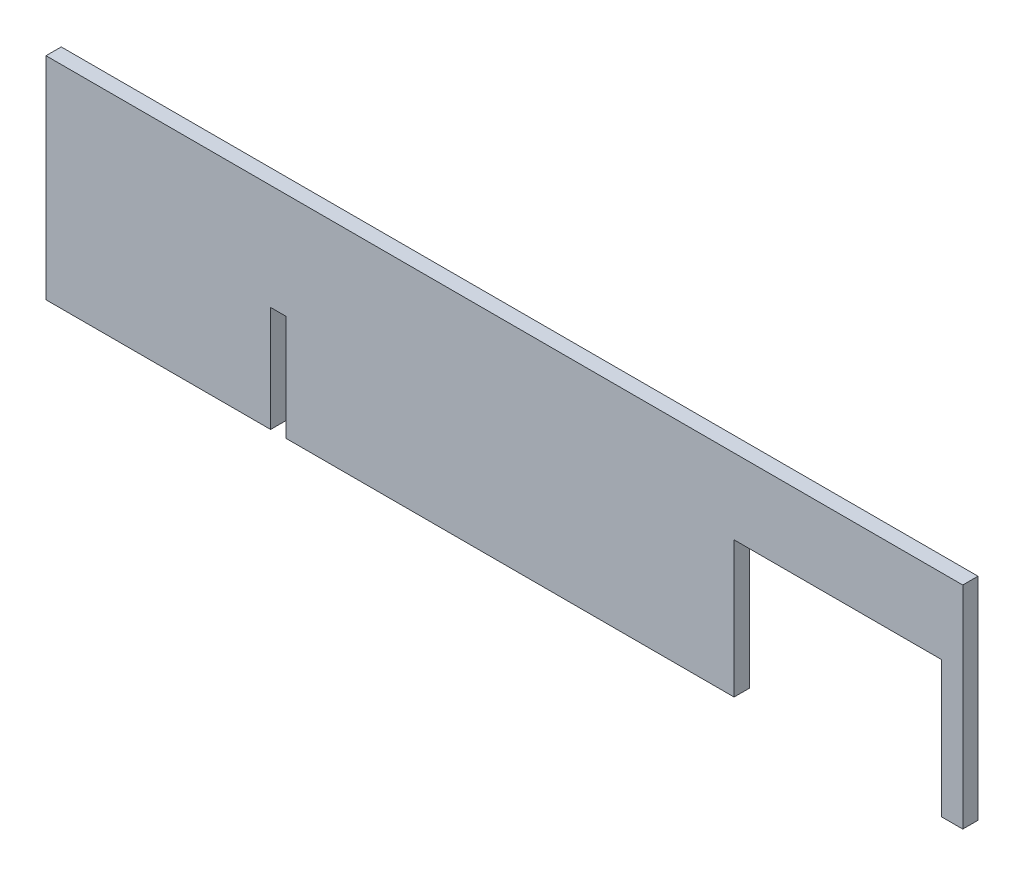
ISO-10303-21;
HEADER;
FILE_DESCRIPTION(('STEP AP214'),'2;1');
FILE_NAME('part.step','',(''),(''),'','','');
FILE_SCHEMA(('AUTOMOTIVE_DESIGN { 1 0 10303 214 1 1 1 1 }'));
ENDSEC;
DATA;
#1=APPLICATION_CONTEXT('core data for automotive mechanical design processes');
#2=APPLICATION_PROTOCOL_DEFINITION('international standard','automotive_design',2000,#1);
#3=PRODUCT_CONTEXT('',#1,'mechanical');
#4=PRODUCT('Part','Part','',(#3));
#5=PRODUCT_RELATED_PRODUCT_CATEGORY('part','',(#4));
#6=PRODUCT_DEFINITION_FORMATION('','',#4);
#7=PRODUCT_DEFINITION_CONTEXT('part definition',#1,'design');
#8=PRODUCT_DEFINITION('design','',#6,#7);
#9=PRODUCT_DEFINITION_SHAPE('','',#8);
#10=(LENGTH_UNIT() NAMED_UNIT(*) SI_UNIT(.MILLI.,.METRE.));
#11=(NAMED_UNIT(*) PLANE_ANGLE_UNIT() SI_UNIT($,.RADIAN.));
#12=(NAMED_UNIT(*) SI_UNIT($,.STERADIAN.) SOLID_ANGLE_UNIT());
#13=UNCERTAINTY_MEASURE_WITH_UNIT(LENGTH_MEASURE(1.E-05),#10,'distance_accuracy_value','');
#14=(GEOMETRIC_REPRESENTATION_CONTEXT(3) GLOBAL_UNCERTAINTY_ASSIGNED_CONTEXT((#13)) GLOBAL_UNIT_ASSIGNED_CONTEXT((#10,
#11,#12)) REPRESENTATION_CONTEXT('',''));
#15=CARTESIAN_POINT('',(0.,0.,0.));
#16=DIRECTION('',(0.,0.,1.));
#17=DIRECTION('',(1.,0.,0.));
#18=AXIS2_PLACEMENT_3D('',#15,#16,#17);
#19=CARTESIAN_POINT('',(0.,0.,3.81));
#20=DIRECTION('',(0.,1.,0.));
#21=DIRECTION('',(-1.,0.,0.));
#22=AXIS2_PLACEMENT_3D('',#19,#20,#21);
#23=PLANE('',#22);
#24=DIRECTION('',(0.,0.,1.));
#25=VECTOR('',#24,1.);
#26=CARTESIAN_POINT('',(-5.334,0.,3.81));
#27=LINE('',#26,#25);
#28=CARTESIAN_POINT('',(-5.334,0.,0.));
#29=VERTEX_POINT('',#28);
#30=CARTESIAN_POINT('',(-5.334,0.,3.81));
#31=VERTEX_POINT('',#30);
#32=EDGE_CURVE('E210',#29,#31,#27,.T.);
#33=ORIENTED_EDGE('',*,*,#32,.F.);
#34=DIRECTION('',(1.,0.,0.));
#35=VECTOR('',#34,1.);
#36=CARTESIAN_POINT('',(0.,0.,0.));
#37=LINE('',#36,#35);
#38=CARTESIAN_POINT('',(0.,0.,0.));
#39=VERTEX_POINT('',#38);
#40=EDGE_CURVE('E141',#29,#39,#37,.T.);
#41=ORIENTED_EDGE('',*,*,#40,.T.);
#42=DIRECTION('',(0.,0.,-1.));
#43=VECTOR('',#42,1.);
#44=CARTESIAN_POINT('',(0.,0.,3.81));
#45=LINE('',#44,#43);
#46=CARTESIAN_POINT('',(0.,0.,3.81));
#47=VERTEX_POINT('',#46);
#48=EDGE_CURVE('E174',#47,#39,#45,.T.);
#49=ORIENTED_EDGE('',*,*,#48,.F.);
#50=DIRECTION('',(1.,0.,0.));
#51=VECTOR('',#50,1.);
#52=CARTESIAN_POINT('',(0.,0.,3.81));
#53=LINE('',#52,#51);
#54=EDGE_CURVE('E170',#31,#47,#53,.T.);
#55=ORIENTED_EDGE('',*,*,#54,.F.);
#56=EDGE_LOOP('',(#33,#41,#49,#55));
#57=FACE_BOUND('',#56,.T.);
#58=ADVANCED_FACE('F31',(#57),#23,.F.);
#59=DIRECTION('',(0.,0.,-1.));
#60=VECTOR('',#59,1.);
#61=CARTESIAN_POINT('',(-57.15,0.,3.81));
#62=LINE('',#61,#60);
#63=CARTESIAN_POINT('',(-57.15,0.,3.81));
#64=VERTEX_POINT('',#63);
#65=CARTESIAN_POINT('',(-57.15,0.,0.));
#66=VERTEX_POINT('',#65);
#67=EDGE_CURVE('E46',#64,#66,#62,.T.);
#68=ORIENTED_EDGE('',*,*,#67,.F.);
#69=CARTESIAN_POINT('',(-169.164,0.,3.81));
#70=VERTEX_POINT('',#69);
#71=EDGE_CURVE('E175',#70,#64,#53,.T.);
#72=ORIENTED_EDGE('',*,*,#71,.F.);
#73=DIRECTION('',(0.,0.,1.));
#74=VECTOR('',#73,1.);
#75=CARTESIAN_POINT('',(-169.164,0.,3.81));
#76=LINE('',#75,#74);
#77=CARTESIAN_POINT('',(-169.164,0.,0.));
#78=VERTEX_POINT('',#77);
#79=EDGE_CURVE('E188',#78,#70,#76,.T.);
#80=ORIENTED_EDGE('',*,*,#79,.F.);
#81=EDGE_CURVE('E147',#78,#66,#37,.T.);
#82=ORIENTED_EDGE('',*,*,#81,.T.);
#83=EDGE_LOOP('',(#68,#72,#80,#82));
#84=FACE_BOUND('',#83,.T.);
#85=ADVANCED_FACE('F197',(#84),#23,.F.);
#86=CARTESIAN_POINT('',(0.,52.832,3.81));
#87=DIRECTION('',(0.,0.,1.));
#88=DIRECTION('',(1.,0.,0.));
#89=AXIS2_PLACEMENT_3D('',#86,#87,#88);
#90=PLANE('',#89);
#91=DIRECTION('',(-1.,0.,0.));
#92=VECTOR('',#91,1.);
#93=CARTESIAN_POINT('',(-5.334,34.036,3.81));
#94=LINE('',#93,#92);
#95=CARTESIAN_POINT('',(-5.334,34.036,3.81));
#96=VERTEX_POINT('',#95);
#97=CARTESIAN_POINT('',(-57.15,34.036,3.81));
#98=VERTEX_POINT('',#97);
#99=EDGE_CURVE('E202',#96,#98,#94,.T.);
#100=ORIENTED_EDGE('',*,*,#99,.F.);
#101=DIRECTION('',(0.,1.,0.));
#102=VECTOR('',#101,1.);
#103=CARTESIAN_POINT('',(-5.334,-0.437303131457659,3.81));
#104=LINE('',#103,#102);
#105=EDGE_CURVE('E136',#31,#96,#104,.T.);
#106=ORIENTED_EDGE('',*,*,#105,.F.);
#107=ORIENTED_EDGE('',*,*,#54,.T.);
#108=DIRECTION('',(0.,1.,0.));
#109=VECTOR('',#108,1.);
#110=CARTESIAN_POINT('',(0.,0.,3.81));
#111=LINE('',#110,#109);
#112=CARTESIAN_POINT('',(0.,52.832,3.81));
#113=VERTEX_POINT('',#112);
#114=EDGE_CURVE('E156',#47,#113,#111,.T.);
#115=ORIENTED_EDGE('',*,*,#114,.T.);
#116=DIRECTION('',(-1.,0.,0.));
#117=VECTOR('',#116,1.);
#118=CARTESIAN_POINT('',(0.,52.832,3.81));
#119=LINE('',#118,#117);
#120=CARTESIAN_POINT('',(-229.108,52.832,3.81));
#121=VERTEX_POINT('',#120);
#122=EDGE_CURVE('E162',#113,#121,#119,.T.);
#123=ORIENTED_EDGE('',*,*,#122,.T.);
#124=DIRECTION('',(0.,-1.,0.));
#125=VECTOR('',#124,1.);
#126=CARTESIAN_POINT('',(-229.108,0.,3.81));
#127=LINE('',#126,#125);
#128=CARTESIAN_POINT('',(-229.108,0.,3.81));
#129=VERTEX_POINT('',#128);
#130=EDGE_CURVE('E166',#121,#129,#127,.T.);
#131=ORIENTED_EDGE('',*,*,#130,.T.);
#132=CARTESIAN_POINT('',(-172.974,0.,3.81));
#133=VERTEX_POINT('',#132);
#134=EDGE_CURVE('E171',#129,#133,#53,.T.);
#135=ORIENTED_EDGE('',*,*,#134,.T.);
#136=DIRECTION('',(0.,-1.,0.));
#137=VECTOR('',#136,1.);
#138=CARTESIAN_POINT('',(-172.974,-8.05730313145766,3.81));
#139=LINE('',#138,#137);
#140=CARTESIAN_POINT('',(-172.974,26.416,3.81));
#141=VERTEX_POINT('',#140);
#142=EDGE_CURVE('E215',#141,#133,#139,.T.);
#143=ORIENTED_EDGE('',*,*,#142,.F.);
#144=DIRECTION('',(-1.,0.,0.));
#145=VECTOR('',#144,1.);
#146=CARTESIAN_POINT('',(-172.974,26.416,3.81));
#147=LINE('',#146,#145);
#148=CARTESIAN_POINT('',(-169.164,26.416,3.81));
#149=VERTEX_POINT('',#148);
#150=EDGE_CURVE('E219',#149,#141,#147,.T.);
#151=ORIENTED_EDGE('',*,*,#150,.F.);
#152=DIRECTION('',(0.,1.,0.));
#153=VECTOR('',#152,1.);
#154=CARTESIAN_POINT('',(-169.164,-8.05730313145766,3.81));
#155=LINE('',#154,#153);
#156=EDGE_CURVE('E217',#70,#149,#155,.T.);
#157=ORIENTED_EDGE('',*,*,#156,.F.);
#158=ORIENTED_EDGE('',*,*,#71,.T.);
#159=DIRECTION('',(0.,-1.,0.));
#160=VECTOR('',#159,1.);
#161=CARTESIAN_POINT('',(-57.15,-0.437303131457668,3.81));
#162=LINE('',#161,#160);
#163=EDGE_CURVE('E206',#98,#64,#162,.T.);
#164=ORIENTED_EDGE('',*,*,#163,.F.);
#165=EDGE_LOOP('',(#100,#106,#107,#115,#123,#131,#135,#143,#151,#157,#158,#164));
#166=FACE_BOUND('',#165,.T.);
#167=ADVANCED_FACE('F239',(#166),#90,.T.);
#168=CARTESIAN_POINT('',(0.,52.832,0.));
#169=DIRECTION('',(0.,0.,1.));
#170=DIRECTION('',(1.,0.,0.));
#171=AXIS2_PLACEMENT_3D('',#168,#169,#170);
#172=PLANE('',#171);
#173=DIRECTION('',(0.,-1.,0.));
#174=VECTOR('',#173,1.);
#175=CARTESIAN_POINT('',(-5.334,52.832,0.));
#176=LINE('',#175,#174);
#177=CARTESIAN_POINT('',(-5.334,34.036,0.));
#178=VERTEX_POINT('',#177);
#179=EDGE_CURVE('E11',#178,#29,#176,.T.);
#180=ORIENTED_EDGE('',*,*,#179,.F.);
#181=DIRECTION('',(-1.,0.,0.));
#182=VECTOR('',#181,1.);
#183=CARTESIAN_POINT('',(-5.334,34.036,0.));
#184=LINE('',#183,#182);
#185=CARTESIAN_POINT('',(-57.15,34.036,0.));
#186=VERTEX_POINT('',#185);
#187=EDGE_CURVE('E121',#178,#186,#184,.T.);
#188=ORIENTED_EDGE('',*,*,#187,.T.);
#189=DIRECTION('',(0.,-1.,0.));
#190=VECTOR('',#189,1.);
#191=CARTESIAN_POINT('',(-57.15,-0.437303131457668,0.));
#192=LINE('',#191,#190);
#193=EDGE_CURVE('E130',#186,#66,#192,.T.);
#194=ORIENTED_EDGE('',*,*,#193,.T.);
#195=ORIENTED_EDGE('',*,*,#81,.F.);
#196=DIRECTION('',(0.,-1.,0.));
#197=VECTOR('',#196,1.);
#198=CARTESIAN_POINT('',(-169.164,52.832,0.));
#199=LINE('',#198,#197);
#200=CARTESIAN_POINT('',(-169.164,26.416,0.));
#201=VERTEX_POINT('',#200);
#202=EDGE_CURVE('E39',#201,#78,#199,.T.);
#203=ORIENTED_EDGE('',*,*,#202,.F.);
#204=DIRECTION('',(-1.,0.,0.));
#205=VECTOR('',#204,1.);
#206=CARTESIAN_POINT('',(-172.974,26.416,0.));
#207=LINE('',#206,#205);
#208=CARTESIAN_POINT('',(-172.974,26.416,0.));
#209=VERTEX_POINT('',#208);
#210=EDGE_CURVE('E213',#201,#209,#207,.T.);
#211=ORIENTED_EDGE('',*,*,#210,.T.);
#212=DIRECTION('',(0.,-1.,0.));
#213=VECTOR('',#212,1.);
#214=CARTESIAN_POINT('',(-172.974,-8.05730313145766,0.));
#215=LINE('',#214,#213);
#216=CARTESIAN_POINT('',(-172.974,0.,0.));
#217=VERTEX_POINT('',#216);
#218=EDGE_CURVE('E54',#209,#217,#215,.T.);
#219=ORIENTED_EDGE('',*,*,#218,.T.);
#220=CARTESIAN_POINT('',(-229.108,0.,0.));
#221=VERTEX_POINT('',#220);
#222=EDGE_CURVE('E150',#221,#217,#37,.T.);
#223=ORIENTED_EDGE('',*,*,#222,.F.);
#224=DIRECTION('',(0.,-1.,0.));
#225=VECTOR('',#224,1.);
#226=CARTESIAN_POINT('',(-229.108,0.,0.));
#227=LINE('',#226,#225);
#228=CARTESIAN_POINT('',(-229.108,52.832,0.));
#229=VERTEX_POINT('',#228);
#230=EDGE_CURVE('E148',#229,#221,#227,.T.);
#231=ORIENTED_EDGE('',*,*,#230,.F.);
#232=DIRECTION('',(-1.,0.,0.));
#233=VECTOR('',#232,1.);
#234=CARTESIAN_POINT('',(0.,52.832,0.));
#235=LINE('',#234,#233);
#236=CARTESIAN_POINT('',(0.,52.832,0.));
#237=VERTEX_POINT('',#236);
#238=EDGE_CURVE('E152',#237,#229,#235,.T.);
#239=ORIENTED_EDGE('',*,*,#238,.F.);
#240=DIRECTION('',(0.,1.,0.));
#241=VECTOR('',#240,1.);
#242=CARTESIAN_POINT('',(0.,0.,0.));
#243=LINE('',#242,#241);
#244=EDGE_CURVE('E143',#39,#237,#243,.T.);
#245=ORIENTED_EDGE('',*,*,#244,.F.);
#246=ORIENTED_EDGE('',*,*,#40,.F.);
#247=EDGE_LOOP('',(#180,#188,#194,#195,#203,#211,#219,#223,#231,#239,#245,#246));
#248=FACE_BOUND('',#247,.T.);
#249=ADVANCED_FACE('F139',(#248),#172,.F.);
#250=DIRECTION('',(0.,0.,-1.));
#251=VECTOR('',#250,1.);
#252=CARTESIAN_POINT('',(-172.974,0.,3.81));
#253=LINE('',#252,#251);
#254=EDGE_CURVE('E199',#133,#217,#253,.T.);
#255=ORIENTED_EDGE('',*,*,#254,.F.);
#256=ORIENTED_EDGE('',*,*,#134,.F.);
#257=DIRECTION('',(0.,0.,-1.));
#258=VECTOR('',#257,1.);
#259=CARTESIAN_POINT('',(-229.108,0.,3.81));
#260=LINE('',#259,#258);
#261=EDGE_CURVE('E177',#129,#221,#260,.T.);
#262=ORIENTED_EDGE('',*,*,#261,.T.);
#263=ORIENTED_EDGE('',*,*,#222,.T.);
#264=EDGE_LOOP('',(#255,#256,#262,#263));
#265=FACE_BOUND('',#264,.T.);
#266=ADVANCED_FACE('F241',(#265),#23,.F.);
#267=CARTESIAN_POINT('',(0.,0.,3.81));
#268=DIRECTION('',(-1.,0.,0.));
#269=DIRECTION('',(0.,0.,1.));
#270=AXIS2_PLACEMENT_3D('',#267,#268,#269);
#271=PLANE('',#270);
#272=ORIENTED_EDGE('',*,*,#244,.T.);
#273=DIRECTION('',(0.,0.,-1.));
#274=VECTOR('',#273,1.);
#275=CARTESIAN_POINT('',(0.,52.832,3.81));
#276=LINE('',#275,#274);
#277=EDGE_CURVE('E182',#113,#237,#276,.T.);
#278=ORIENTED_EDGE('',*,*,#277,.F.);
#279=ORIENTED_EDGE('',*,*,#114,.F.);
#280=ORIENTED_EDGE('',*,*,#48,.T.);
#281=EDGE_LOOP('',(#272,#278,#279,#280));
#282=FACE_BOUND('',#281,.T.);
#283=ADVANCED_FACE('F33',(#282),#271,.F.);
#284=CARTESIAN_POINT('',(0.,52.832,3.81));
#285=DIRECTION('',(0.,-1.,0.));
#286=DIRECTION('',(1.,0.,0.));
#287=AXIS2_PLACEMENT_3D('',#284,#285,#286);
#288=PLANE('',#287);
#289=ORIENTED_EDGE('',*,*,#238,.T.);
#290=DIRECTION('',(0.,0.,-1.));
#291=VECTOR('',#290,1.);
#292=CARTESIAN_POINT('',(-229.108,52.832,3.81));
#293=LINE('',#292,#291);
#294=EDGE_CURVE('E179',#121,#229,#293,.T.);
#295=ORIENTED_EDGE('',*,*,#294,.F.);
#296=ORIENTED_EDGE('',*,*,#122,.F.);
#297=ORIENTED_EDGE('',*,*,#277,.T.);
#298=EDGE_LOOP('',(#289,#295,#296,#297));
#299=FACE_BOUND('',#298,.T.);
#300=ADVANCED_FACE('F228',(#299),#288,.F.);
#301=CARTESIAN_POINT('',(-229.108,0.,3.81));
#302=DIRECTION('',(1.,0.,0.));
#303=DIRECTION('',(0.,0.,-1.));
#304=AXIS2_PLACEMENT_3D('',#301,#302,#303);
#305=PLANE('',#304);
#306=ORIENTED_EDGE('',*,*,#230,.T.);
#307=ORIENTED_EDGE('',*,*,#261,.F.);
#308=ORIENTED_EDGE('',*,*,#130,.F.);
#309=ORIENTED_EDGE('',*,*,#294,.T.);
#310=EDGE_LOOP('',(#306,#307,#308,#309));
#311=FACE_BOUND('',#310,.T.);
#312=ADVANCED_FACE('F232',(#311),#305,.F.);
#313=CARTESIAN_POINT('',(-172.974,-8.05730313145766,3.81));
#314=DIRECTION('',(1.,0.,0.));
#315=DIRECTION('',(0.,0.,-1.));
#316=AXIS2_PLACEMENT_3D('',#313,#314,#315);
#317=PLANE('',#316);
#318=ORIENTED_EDGE('',*,*,#254,.T.);
#319=ORIENTED_EDGE('',*,*,#218,.F.);
#320=DIRECTION('',(0.,0.,-1.));
#321=VECTOR('',#320,1.);
#322=CARTESIAN_POINT('',(-172.974,26.416,3.81));
#323=LINE('',#322,#321);
#324=EDGE_CURVE('E221',#141,#209,#323,.T.);
#325=ORIENTED_EDGE('',*,*,#324,.F.);
#326=ORIENTED_EDGE('',*,*,#142,.T.);
#327=EDGE_LOOP('',(#318,#319,#325,#326));
#328=FACE_BOUND('',#327,.T.);
#329=ADVANCED_FACE('F238',(#328),#317,.T.);
#330=CARTESIAN_POINT('',(-169.164,-8.05730313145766,3.81));
#331=DIRECTION('',(-1.,0.,0.));
#332=DIRECTION('',(0.,0.,1.));
#333=AXIS2_PLACEMENT_3D('',#330,#331,#332);
#334=PLANE('',#333);
#335=ORIENTED_EDGE('',*,*,#79,.T.);
#336=ORIENTED_EDGE('',*,*,#156,.T.);
#337=DIRECTION('',(0.,0.,-1.));
#338=VECTOR('',#337,1.);
#339=CARTESIAN_POINT('',(-169.164,26.416,3.81));
#340=LINE('',#339,#338);
#341=EDGE_CURVE('E191',#149,#201,#340,.T.);
#342=ORIENTED_EDGE('',*,*,#341,.T.);
#343=ORIENTED_EDGE('',*,*,#202,.T.);
#344=EDGE_LOOP('',(#335,#336,#342,#343));
#345=FACE_BOUND('',#344,.T.);
#346=ADVANCED_FACE('F187',(#345),#334,.T.);
#347=CARTESIAN_POINT('',(-172.974,26.416,3.81));
#348=DIRECTION('',(0.,-1.,0.));
#349=DIRECTION('',(0.,0.,-1.));
#350=AXIS2_PLACEMENT_3D('',#347,#348,#349);
#351=PLANE('',#350);
#352=ORIENTED_EDGE('',*,*,#210,.F.);
#353=ORIENTED_EDGE('',*,*,#341,.F.);
#354=ORIENTED_EDGE('',*,*,#150,.T.);
#355=ORIENTED_EDGE('',*,*,#324,.T.);
#356=EDGE_LOOP('',(#352,#353,#354,#355));
#357=FACE_BOUND('',#356,.T.);
#358=ADVANCED_FACE('F235',(#357),#351,.T.);
#359=CARTESIAN_POINT('',(-5.334,-0.437303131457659,3.81));
#360=DIRECTION('',(-1.,0.,0.));
#361=DIRECTION('',(0.,0.,1.));
#362=AXIS2_PLACEMENT_3D('',#359,#360,#361);
#363=PLANE('',#362);
#364=ORIENTED_EDGE('',*,*,#32,.T.);
#365=ORIENTED_EDGE('',*,*,#105,.T.);
#366=DIRECTION('',(0.,0.,-1.));
#367=VECTOR('',#366,1.);
#368=CARTESIAN_POINT('',(-5.334,34.036,3.81));
#369=LINE('',#368,#367);
#370=EDGE_CURVE('E124',#96,#178,#369,.T.);
#371=ORIENTED_EDGE('',*,*,#370,.T.);
#372=ORIENTED_EDGE('',*,*,#179,.T.);
#373=EDGE_LOOP('',(#364,#365,#371,#372));
#374=FACE_BOUND('',#373,.T.);
#375=ADVANCED_FACE('F133',(#374),#363,.T.);
#376=CARTESIAN_POINT('',(-57.15,-0.437303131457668,3.81));
#377=DIRECTION('',(1.,0.,0.));
#378=DIRECTION('',(0.,0.,-1.));
#379=AXIS2_PLACEMENT_3D('',#376,#377,#378);
#380=PLANE('',#379);
#381=ORIENTED_EDGE('',*,*,#67,.T.);
#382=ORIENTED_EDGE('',*,*,#193,.F.);
#383=DIRECTION('',(0.,0.,-1.));
#384=VECTOR('',#383,1.);
#385=CARTESIAN_POINT('',(-57.15,34.036,3.81));
#386=LINE('',#385,#384);
#387=EDGE_CURVE('E127',#98,#186,#386,.T.);
#388=ORIENTED_EDGE('',*,*,#387,.F.);
#389=ORIENTED_EDGE('',*,*,#163,.T.);
#390=EDGE_LOOP('',(#381,#382,#388,#389));
#391=FACE_BOUND('',#390,.T.);
#392=ADVANCED_FACE('F268',(#391),#380,.T.);
#393=CARTESIAN_POINT('',(-5.334,34.036,3.81));
#394=DIRECTION('',(0.,-1.,0.));
#395=DIRECTION('',(1.,0.,0.));
#396=AXIS2_PLACEMENT_3D('',#393,#394,#395);
#397=PLANE('',#396);
#398=ORIENTED_EDGE('',*,*,#187,.F.);
#399=ORIENTED_EDGE('',*,*,#370,.F.);
#400=ORIENTED_EDGE('',*,*,#99,.T.);
#401=ORIENTED_EDGE('',*,*,#387,.T.);
#402=EDGE_LOOP('',(#398,#399,#400,#401));
#403=FACE_BOUND('',#402,.T.);
#404=ADVANCED_FACE('F123',(#403),#397,.T.);
#405=CLOSED_SHELL('',(#58,#85,#167,#249,#266,#283,#300,#312,#329,#346,#358,#375,#392,#404));
#406=MANIFOLD_SOLID_BREP('B2',#405);
#407=ADVANCED_BREP_SHAPE_REPRESENTATION('',(#18,#406),#14);
#408=SHAPE_DEFINITION_REPRESENTATION(#9,#407);
ENDSEC;
END-ISO-10303-21;
